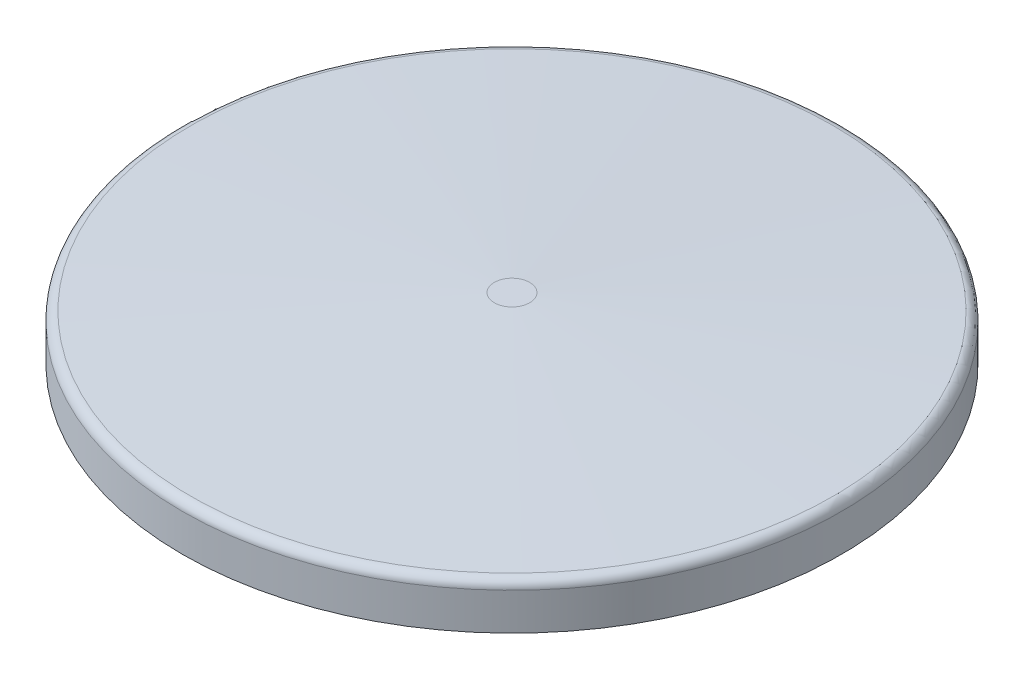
from build123d import *

# Parameters (mm, degrees)
F_13_64_0_20313_DIAMETER_HOLE1_D     = 5.159502
F_13_64_0_20313_DIAMETER_HOLE1_DEPTH = 11.43
CIRPATTERN1_COUNT                    = 16


with BuildPart() as part:
    # Sketch1 → Revolve1 (revolve)
    with BuildSketch(Plane.XY, mode=Mode.PRIVATE) as revolve1_sk:
        with BuildLine():
            Line((-117.475, 0), (-95, 0))
            Line((-95, 0), (-95, 5.996893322))
            ThreePointArc((-95, 5.996893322), (-93.140128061, 10.487021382), (-88.65, 12.346893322))
            Line((-88.65, 12.346893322), (0, 12.346893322))
            Line((0, 12.346893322), (0, 22.082657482))
            Line((0, 22.082657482), (-6.295752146, 22.082657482))
            Line((-6.295752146, 22.082657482), (-114.466166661, 16.413686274))
            ThreePointArc((-114.466166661, 16.413686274), (-116.603063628, 15.428563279), (-117.475, 13.243037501))
            Line((-117.475, 13.243037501), (-117.475, 0))
        make_face()
    revolve(revolve1_sk.sketch.rotate(Axis((0, 0, 0), (0, 1, 0)), 270), axis=Axis((0, 0, 0), (0, 1, 0)))

    # Sketch6 → Cut-Revolve1 2-268 ORing (revolve, cut)
    with BuildSketch(Plane.XY, mode=Mode.PRIVATE) as cut_revolve1_2_268_oring_sk:
        with BuildLine():
            Line((-112.4966, 0), (-107.6198, 0))
            ThreePointArc((-107.6198, 0), (-107.709602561, 0.037197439), (-107.7468, 0.127))
            Line((-107.7468, 0.127), (-107.7468, 2.1971))
            ThreePointArc((-107.7468, 2.1971), (-107.876991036, 2.511408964), (-108.1913, 2.6416))
            Line((-108.1913, 2.6416), (-111.9251, 2.6416))
            ThreePointArc((-111.9251, 2.6416), (-112.239408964, 2.511408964), (-112.3696, 2.1971))
            Line((-112.3696, 2.1971), (-112.3696, 0.127))
            ThreePointArc((-112.3696, 0.127), (-112.406797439, 0.037197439), (-112.4966, 0))
        make_face()
    revolve(cut_revolve1_2_268_oring_sk.sketch.rotate(Axis((0, 0, 0), (0, 1, 0)), 270), axis=Axis((0, 0, 0), (0, 1, 0)), mode=Mode.SUBTRACT)

    # 13_64 _0.20313_ Diameter Hole1
    with Locations(Plane(origin=(0, 0, 0), x_dir=(-1, 0, 0), z_dir=(0, -1, 0))):
        with Locations((0, 102)):
            f_13_64_0_20313_diameter_hole1 = Hole(F_13_64_0_20313_DIAMETER_HOLE1_D / 2, depth=F_13_64_0_20313_DIAMETER_HOLE1_DEPTH)

    # CirPattern1: 13_64 _0.20313_ Diameter Hole1 ×16 about axis
    cirpattern1_axis = Axis((0, 0, 0), (0, 1, 0))
    for i in range(1, CIRPATTERN1_COUNT):
        add(f_13_64_0_20313_diameter_hole1.rotate(cirpattern1_axis, i * 360 / CIRPATTERN1_COUNT), mode=Mode.SUBTRACT)


solid = part.part
